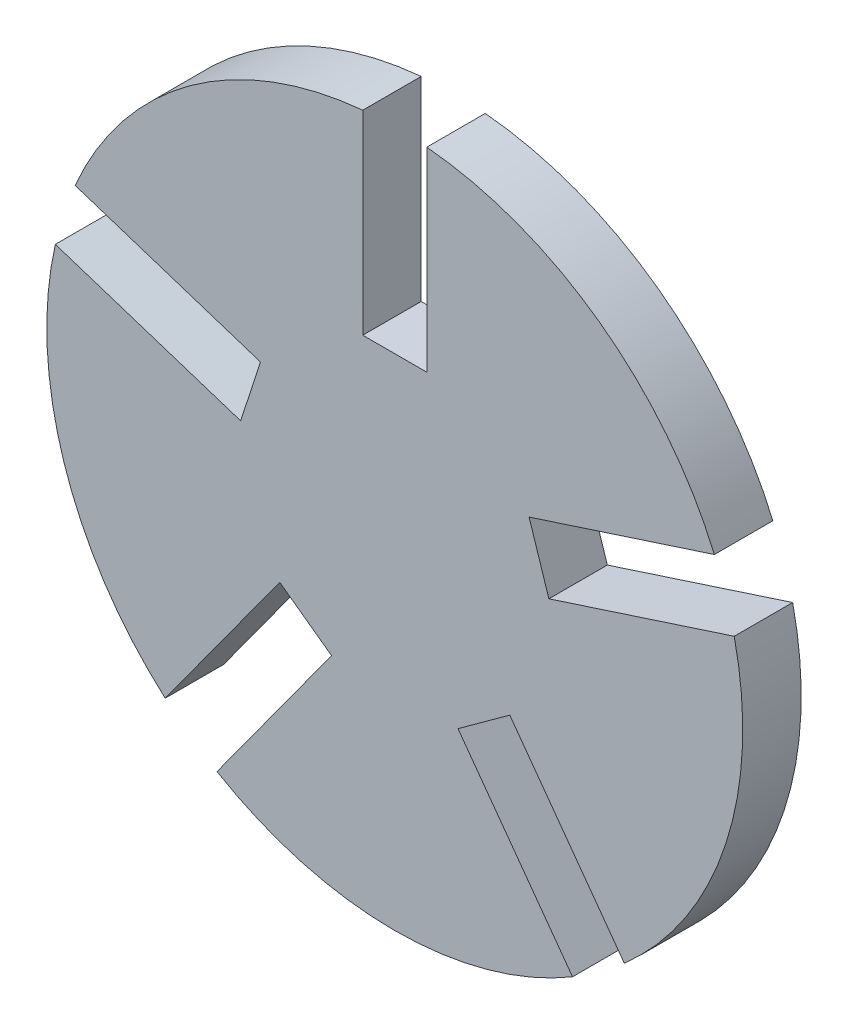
ISO-10303-21;
HEADER;
FILE_DESCRIPTION(('STEP AP214'),'2;1');
FILE_NAME('part.step','',(''),(''),'','','');
FILE_SCHEMA(('AUTOMOTIVE_DESIGN { 1 0 10303 214 1 1 1 1 }'));
ENDSEC;
DATA;
#1=APPLICATION_CONTEXT('core data for automotive mechanical design processes');
#2=APPLICATION_PROTOCOL_DEFINITION('international standard','automotive_design',2000,#1);
#3=PRODUCT_CONTEXT('',#1,'mechanical');
#4=PRODUCT('Part','Part','',(#3));
#5=PRODUCT_RELATED_PRODUCT_CATEGORY('part','',(#4));
#6=PRODUCT_DEFINITION_FORMATION('','',#4);
#7=PRODUCT_DEFINITION_CONTEXT('part definition',#1,'design');
#8=PRODUCT_DEFINITION('design','',#6,#7);
#9=PRODUCT_DEFINITION_SHAPE('','',#8);
#10=(LENGTH_UNIT() NAMED_UNIT(*) SI_UNIT(.MILLI.,.METRE.));
#11=(NAMED_UNIT(*) PLANE_ANGLE_UNIT() SI_UNIT($,.RADIAN.));
#12=(NAMED_UNIT(*) SI_UNIT($,.STERADIAN.) SOLID_ANGLE_UNIT());
#13=UNCERTAINTY_MEASURE_WITH_UNIT(LENGTH_MEASURE(1.E-05),#10,'distance_accuracy_value','');
#14=(GEOMETRIC_REPRESENTATION_CONTEXT(3) GLOBAL_UNCERTAINTY_ASSIGNED_CONTEXT((#13)) GLOBAL_UNIT_ASSIGNED_CONTEXT((#10,
#11,#12)) REPRESENTATION_CONTEXT('',''));
#15=CARTESIAN_POINT('',(0.,0.,0.));
#16=DIRECTION('',(0.,0.,1.));
#17=DIRECTION('',(1.,0.,0.));
#18=AXIS2_PLACEMENT_3D('',#15,#16,#17);
#19=CARTESIAN_POINT('',(0.,0.,2.1));
#20=DIRECTION('',(0.,0.,-1.));
#21=DIRECTION('',(-1.,0.,0.));
#22=AXIS2_PLACEMENT_3D('',#19,#20,#21);
#23=CYLINDRICAL_SURFACE('',#22,25.);
#24=CARTESIAN_POINT('',(0.,0.,-2.1));
#25=DIRECTION('',(0.,0.,1.));
#26=DIRECTION('',(1.,0.,0.));
#27=AXIS2_PLACEMENT_3D('',#24,#25,#26);
#28=CIRCLE('',#27,25.);
#29=CARTESIAN_POINT('',(-2.3,24.8939751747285,-2.1));
#30=VERTEX_POINT('',#29);
#31=CARTESIAN_POINT('',(-22.9648382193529,9.88009137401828,-2.1));
#32=VERTEX_POINT('',#31);
#33=EDGE_CURVE('E212',#30,#32,#28,.T.);
#34=ORIENTED_EDGE('',*,*,#33,.T.);
#35=DIRECTION('',(0.,0.,-1.));
#36=VECTOR('',#35,1.);
#37=CARTESIAN_POINT('',(-22.9648382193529,9.88009137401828,2.1));
#38=LINE('',#37,#36);
#39=CARTESIAN_POINT('',(-22.9648382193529,9.88009137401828,2.1));
#40=VERTEX_POINT('',#39);
#41=EDGE_CURVE('E11',#40,#32,#38,.T.);
#42=ORIENTED_EDGE('',*,*,#41,.F.);
#43=CARTESIAN_POINT('',(0.,0.,2.1));
#44=DIRECTION('',(0.,0.,1.));
#45=DIRECTION('',(1.,0.,0.));
#46=AXIS2_PLACEMENT_3D('',#43,#44,#45);
#47=CIRCLE('',#46,25.);
#48=CARTESIAN_POINT('',(-2.3,24.8939751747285,2.1));
#49=VERTEX_POINT('',#48);
#50=EDGE_CURVE('E270',#49,#40,#47,.T.);
#51=ORIENTED_EDGE('',*,*,#50,.F.);
#52=DIRECTION('',(0.,0.,-1.));
#53=VECTOR('',#52,1.);
#54=CARTESIAN_POINT('',(-2.3,24.8939751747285,2.1));
#55=LINE('',#54,#53);
#56=EDGE_CURVE('E208',#49,#30,#55,.T.);
#57=ORIENTED_EDGE('',*,*,#56,.T.);
#58=EDGE_LOOP('',(#34,#42,#51,#57));
#59=FACE_BOUND('',#58,.T.);
#60=ADVANCED_FACE('F39',(#59),#23,.T.);
#61=CARTESIAN_POINT('',(-22.9648382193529,9.88009137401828,2.1));
#62=DIRECTION('',(0.309016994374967,0.951056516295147,0.));
#63=DIRECTION('',(-0.951056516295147,0.309016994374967,0.));
#64=AXIS2_PLACEMENT_3D('',#61,#62,#63);
#65=PLANE('',#64);
#66=DIRECTION('',(0.951056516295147,-0.309016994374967,0.));
#67=VECTOR('',#66,1.);
#68=CARTESIAN_POINT('',(-22.9648382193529,9.88009137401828,-2.1));
#69=LINE('',#68,#67);
#70=CARTESIAN_POINT('',(-9.65004699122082,5.55385345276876,-2.1));
#71=VERTEX_POINT('',#70);
#72=EDGE_CURVE('E216',#32,#71,#69,.T.);
#73=ORIENTED_EDGE('',*,*,#72,.T.);
#74=DIRECTION('',(0.,0.,-1.));
#75=VECTOR('',#74,1.);
#76=CARTESIAN_POINT('',(-9.65004699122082,5.55385345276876,2.1));
#77=LINE('',#76,#75);
#78=CARTESIAN_POINT('',(-9.65004699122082,5.55385345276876,2.1));
#79=VERTEX_POINT('',#78);
#80=EDGE_CURVE('E48',#79,#71,#77,.T.);
#81=ORIENTED_EDGE('',*,*,#80,.F.);
#82=DIRECTION('',(0.951056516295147,-0.309016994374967,0.));
#83=VECTOR('',#82,1.);
#84=CARTESIAN_POINT('',(-22.9648382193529,9.88009137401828,2.1));
#85=LINE('',#84,#83);
#86=EDGE_CURVE('E135',#40,#79,#85,.T.);
#87=ORIENTED_EDGE('',*,*,#86,.F.);
#88=ORIENTED_EDGE('',*,*,#41,.T.);
#89=EDGE_LOOP('',(#73,#81,#87,#88));
#90=FACE_BOUND('',#89,.T.);
#91=ADVANCED_FACE('F420',(#90),#65,.F.);
#92=CARTESIAN_POINT('',(-11.0715251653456,1.17899347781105,2.1));
#93=DIRECTION('',(0.951056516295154,-0.309016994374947,0.));
#94=DIRECTION('',(0.309016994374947,0.951056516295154,0.));
#95=AXIS2_PLACEMENT_3D('',#92,#93,#94);
#96=PLANE('',#95);
#97=DIRECTION('',(-0.309016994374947,-0.951056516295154,0.));
#98=VECTOR('',#97,1.);
#99=CARTESIAN_POINT('',(-11.0715251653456,1.17899347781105,-2.1));
#100=LINE('',#99,#98);
#101=CARTESIAN_POINT('',(-11.0715251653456,1.17899347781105,-2.1));
#102=VERTEX_POINT('',#101);
#103=EDGE_CURVE('E219',#71,#102,#100,.T.);
#104=ORIENTED_EDGE('',*,*,#103,.T.);
#105=DIRECTION('',(0.,0.,-1.));
#106=VECTOR('',#105,1.);
#107=CARTESIAN_POINT('',(-11.0715251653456,1.17899347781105,2.1));
#108=LINE('',#107,#106);
#109=CARTESIAN_POINT('',(-11.0715251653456,1.17899347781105,2.1));
#110=VERTEX_POINT('',#109);
#111=EDGE_CURVE('E329',#110,#102,#108,.T.);
#112=ORIENTED_EDGE('',*,*,#111,.F.);
#113=DIRECTION('',(-0.309016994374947,-0.951056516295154,0.));
#114=VECTOR('',#113,1.);
#115=CARTESIAN_POINT('',(-11.0715251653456,1.17899347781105,2.1));
#116=LINE('',#115,#114);
#117=EDGE_CURVE('E339',#79,#110,#116,.T.);
#118=ORIENTED_EDGE('',*,*,#117,.F.);
#119=ORIENTED_EDGE('',*,*,#80,.T.);
#120=EDGE_LOOP('',(#104,#112,#118,#119));
#121=FACE_BOUND('',#120,.T.);
#122=ADVANCED_FACE('F337',(#121),#96,.F.);
#123=CARTESIAN_POINT('',(-24.3863163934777,5.50523139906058,2.1));
#124=DIRECTION('',(-0.309016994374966,-0.951056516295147,0.));
#125=DIRECTION('',(0.951056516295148,-0.309016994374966,0.));
#126=AXIS2_PLACEMENT_3D('',#123,#124,#125);
#127=PLANE('',#126);
#128=DIRECTION('',(-0.951056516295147,0.309016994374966,0.));
#129=VECTOR('',#128,1.);
#130=CARTESIAN_POINT('',(-24.3863163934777,5.50523139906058,-2.1));
#131=LINE('',#130,#129);
#132=CARTESIAN_POINT('',(-24.3863163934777,5.50523139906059,-2.1));
#133=VERTEX_POINT('',#132);
#134=EDGE_CURVE('E222',#102,#133,#131,.T.);
#135=ORIENTED_EDGE('',*,*,#134,.T.);
#136=DIRECTION('',(0.,0.,-1.));
#137=VECTOR('',#136,1.);
#138=CARTESIAN_POINT('',(-24.3863163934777,5.50523139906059,2.1));
#139=LINE('',#138,#137);
#140=CARTESIAN_POINT('',(-24.3863163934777,5.50523139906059,2.1));
#141=VERTEX_POINT('',#140);
#142=EDGE_CURVE('E325',#141,#133,#139,.T.);
#143=ORIENTED_EDGE('',*,*,#142,.F.);
#144=DIRECTION('',(-0.951056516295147,0.309016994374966,0.));
#145=VECTOR('',#144,1.);
#146=CARTESIAN_POINT('',(-24.3863163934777,5.50523139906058,2.1));
#147=LINE('',#146,#145);
#148=EDGE_CURVE('E358',#110,#141,#147,.T.);
#149=ORIENTED_EDGE('',*,*,#148,.F.);
#150=ORIENTED_EDGE('',*,*,#111,.T.);
#151=EDGE_LOOP('',(#135,#143,#149,#150));
#152=FACE_BOUND('',#151,.T.);
#153=ADVANCED_FACE('F348',(#152),#127,.F.);
#154=CARTESIAN_POINT('',(0.,0.,2.1));
#155=DIRECTION('',(0.,0.,-1.));
#156=DIRECTION('',(-1.,0.,0.));
#157=AXIS2_PLACEMENT_3D('',#154,#155,#156);
#158=CYLINDRICAL_SURFACE('',#157,25.);
#159=CARTESIAN_POINT('',(0.,0.,-2.1));
#160=DIRECTION('',(0.,0.,1.));
#161=DIRECTION('',(1.,0.,0.));
#162=AXIS2_PLACEMENT_3D('',#159,#160,#161);
#163=CIRCLE('',#162,25.);
#164=CARTESIAN_POINT('',(-16.4930505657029,-18.7877428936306,-2.1));
#165=VERTEX_POINT('',#164);
#166=EDGE_CURVE('E225',#133,#165,#163,.T.);
#167=ORIENTED_EDGE('',*,*,#166,.T.);
#168=DIRECTION('',(0.,0.,-1.));
#169=VECTOR('',#168,1.);
#170=CARTESIAN_POINT('',(-16.4930505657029,-18.7877428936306,2.1));
#171=LINE('',#170,#169);
#172=CARTESIAN_POINT('',(-16.4930505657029,-18.7877428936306,2.1));
#173=VERTEX_POINT('',#172);
#174=EDGE_CURVE('E321',#173,#165,#171,.T.);
#175=ORIENTED_EDGE('',*,*,#174,.F.);
#176=CARTESIAN_POINT('',(0.,0.,2.1));
#177=DIRECTION('',(0.,0.,1.));
#178=DIRECTION('',(1.,0.,0.));
#179=AXIS2_PLACEMENT_3D('',#176,#177,#178);
#180=CIRCLE('',#179,25.);
#181=EDGE_CURVE('E354',#141,#173,#180,.T.);
#182=ORIENTED_EDGE('',*,*,#181,.F.);
#183=ORIENTED_EDGE('',*,*,#142,.T.);
#184=EDGE_LOOP('',(#167,#175,#182,#183));
#185=FACE_BOUND('',#184,.T.);
#186=ADVANCED_FACE('F352',(#185),#158,.T.);
#187=CARTESIAN_POINT('',(-16.4930505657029,-18.7877428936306,2.1));
#188=DIRECTION('',(-0.809016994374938,0.587785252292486,0.));
#189=DIRECTION('',(-0.587785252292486,-0.809016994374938,0.));
#190=AXIS2_PLACEMENT_3D('',#187,#188,#189);
#191=PLANE('',#190);
#192=DIRECTION('',(0.587785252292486,0.809016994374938,0.));
#193=VECTOR('',#192,1.);
#194=CARTESIAN_POINT('',(-16.4930505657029,-18.7877428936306,-2.1));
#195=LINE('',#194,#193);
#196=CARTESIAN_POINT('',(-8.26405703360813,-7.46150497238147,-2.1));
#197=VERTEX_POINT('',#196);
#198=EDGE_CURVE('E228',#165,#197,#195,.T.);
#199=ORIENTED_EDGE('',*,*,#198,.T.);
#200=DIRECTION('',(0.,0.,-1.));
#201=VECTOR('',#200,1.);
#202=CARTESIAN_POINT('',(-8.26405703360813,-7.46150497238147,2.1));
#203=LINE('',#202,#201);
#204=CARTESIAN_POINT('',(-8.26405703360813,-7.46150497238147,2.1));
#205=VERTEX_POINT('',#204);
#206=EDGE_CURVE('E317',#205,#197,#203,.T.);
#207=ORIENTED_EDGE('',*,*,#206,.F.);
#208=DIRECTION('',(0.587785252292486,0.809016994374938,0.));
#209=VECTOR('',#208,1.);
#210=CARTESIAN_POINT('',(-16.4930505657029,-18.7877428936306,2.1));
#211=LINE('',#210,#209);
#212=EDGE_CURVE('E357',#173,#205,#211,.T.);
#213=ORIENTED_EDGE('',*,*,#212,.F.);
#214=ORIENTED_EDGE('',*,*,#174,.T.);
#215=EDGE_LOOP('',(#199,#207,#213,#214));
#216=FACE_BOUND('',#215,.T.);
#217=ADVANCED_FACE('F433',(#216),#191,.F.);
#218=CARTESIAN_POINT('',(-4.54257885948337,-10.1653171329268,2.1));
#219=DIRECTION('',(0.587785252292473,0.809016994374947,0.));
#220=DIRECTION('',(-0.809016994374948,0.587785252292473,0.));
#221=AXIS2_PLACEMENT_3D('',#218,#219,#220);
#222=PLANE('',#221);
#223=DIRECTION('',(0.809016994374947,-0.587785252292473,0.));
#224=VECTOR('',#223,1.);
#225=CARTESIAN_POINT('',(-4.54257885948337,-10.1653171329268,-2.1));
#226=LINE('',#225,#224);
#227=CARTESIAN_POINT('',(-4.54257885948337,-10.1653171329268,-2.1));
#228=VERTEX_POINT('',#227);
#229=EDGE_CURVE('E231',#197,#228,#226,.T.);
#230=ORIENTED_EDGE('',*,*,#229,.T.);
#231=DIRECTION('',(0.,0.,-1.));
#232=VECTOR('',#231,1.);
#233=CARTESIAN_POINT('',(-4.54257885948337,-10.1653171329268,2.1));
#234=LINE('',#233,#232);
#235=CARTESIAN_POINT('',(-4.54257885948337,-10.1653171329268,2.1));
#236=VERTEX_POINT('',#235);
#237=EDGE_CURVE('E313',#236,#228,#234,.T.);
#238=ORIENTED_EDGE('',*,*,#237,.F.);
#239=DIRECTION('',(0.809016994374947,-0.587785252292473,0.));
#240=VECTOR('',#239,1.);
#241=CARTESIAN_POINT('',(-4.54257885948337,-10.1653171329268,2.1));
#242=LINE('',#241,#240);
#243=EDGE_CURVE('E362',#205,#236,#242,.T.);
#244=ORIENTED_EDGE('',*,*,#243,.F.);
#245=ORIENTED_EDGE('',*,*,#206,.T.);
#246=EDGE_LOOP('',(#230,#238,#244,#245));
#247=FACE_BOUND('',#246,.T.);
#248=ADVANCED_FACE('F436',(#247),#222,.F.);
#249=CARTESIAN_POINT('',(-12.7715723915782,-21.491555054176,2.1));
#250=DIRECTION('',(0.809016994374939,-0.587785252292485,0.));
#251=DIRECTION('',(0.587785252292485,0.809016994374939,0.));
#252=AXIS2_PLACEMENT_3D('',#249,#250,#251);
#253=PLANE('',#252);
#254=DIRECTION('',(-0.587785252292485,-0.809016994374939,0.));
#255=VECTOR('',#254,1.);
#256=CARTESIAN_POINT('',(-12.7715723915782,-21.491555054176,-2.1));
#257=LINE('',#256,#255);
#258=CARTESIAN_POINT('',(-12.7715723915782,-21.491555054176,-2.1));
#259=VERTEX_POINT('',#258);
#260=EDGE_CURVE('E234',#228,#259,#257,.T.);
#261=ORIENTED_EDGE('',*,*,#260,.T.);
#262=DIRECTION('',(0.,0.,-1.));
#263=VECTOR('',#262,1.);
#264=CARTESIAN_POINT('',(-12.7715723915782,-21.491555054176,2.1));
#265=LINE('',#264,#263);
#266=CARTESIAN_POINT('',(-12.7715723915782,-21.491555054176,2.1));
#267=VERTEX_POINT('',#266);
#268=EDGE_CURVE('E309',#267,#259,#265,.T.);
#269=ORIENTED_EDGE('',*,*,#268,.F.);
#270=DIRECTION('',(-0.587785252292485,-0.809016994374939,0.));
#271=VECTOR('',#270,1.);
#272=CARTESIAN_POINT('',(-12.7715723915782,-21.491555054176,2.1));
#273=LINE('',#272,#271);
#274=EDGE_CURVE('E369',#236,#267,#273,.T.);
#275=ORIENTED_EDGE('',*,*,#274,.F.);
#276=ORIENTED_EDGE('',*,*,#237,.T.);
#277=EDGE_LOOP('',(#261,#269,#275,#276));
#278=FACE_BOUND('',#277,.T.);
#279=ADVANCED_FACE('F440',(#278),#253,.F.);
#280=CARTESIAN_POINT('',(0.,0.,2.1));
#281=DIRECTION('',(0.,0.,-1.));
#282=DIRECTION('',(-1.,0.,0.));
#283=AXIS2_PLACEMENT_3D('',#280,#281,#282);
#284=CYLINDRICAL_SURFACE('',#283,25.);
#285=CARTESIAN_POINT('',(0.,0.,-2.1));
#286=DIRECTION('',(0.,0.,1.));
#287=DIRECTION('',(1.,0.,0.));
#288=AXIS2_PLACEMENT_3D('',#285,#286,#287);
#289=CIRCLE('',#288,25.);
#290=CARTESIAN_POINT('',(12.7715723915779,-21.4915550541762,-2.1));
#291=VERTEX_POINT('',#290);
#292=EDGE_CURVE('E237',#259,#291,#289,.T.);
#293=ORIENTED_EDGE('',*,*,#292,.T.);
#294=DIRECTION('',(0.,0.,-1.));
#295=VECTOR('',#294,1.);
#296=CARTESIAN_POINT('',(12.7715723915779,-21.4915550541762,2.1));
#297=LINE('',#296,#295);
#298=CARTESIAN_POINT('',(12.7715723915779,-21.4915550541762,2.1));
#299=VERTEX_POINT('',#298);
#300=EDGE_CURVE('E305',#299,#291,#297,.T.);
#301=ORIENTED_EDGE('',*,*,#300,.F.);
#302=CARTESIAN_POINT('',(0.,0.,2.1));
#303=DIRECTION('',(0.,0.,1.));
#304=DIRECTION('',(1.,0.,0.));
#305=AXIS2_PLACEMENT_3D('',#302,#303,#304);
#306=CIRCLE('',#305,25.);
#307=EDGE_CURVE('E372',#267,#299,#306,.T.);
#308=ORIENTED_EDGE('',*,*,#307,.F.);
#309=ORIENTED_EDGE('',*,*,#268,.T.);
#310=EDGE_LOOP('',(#293,#301,#308,#309));
#311=FACE_BOUND('',#310,.T.);
#312=ADVANCED_FACE('F444',(#311),#284,.T.);
#313=CARTESIAN_POINT('',(12.7715723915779,-21.4915550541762,2.1));
#314=DIRECTION('',(-0.809016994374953,-0.587785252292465,0.));
#315=DIRECTION('',(0.587785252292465,-0.809016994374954,0.));
#316=AXIS2_PLACEMENT_3D('',#313,#314,#315);
#317=PLANE('',#316);
#318=DIRECTION('',(-0.587785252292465,0.809016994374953,0.));
#319=VECTOR('',#318,1.);
#320=CARTESIAN_POINT('',(12.7715723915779,-21.4915550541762,-2.1));
#321=LINE('',#320,#319);
#322=CARTESIAN_POINT('',(4.54257885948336,-10.1653171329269,-2.1));
#323=VERTEX_POINT('',#322);
#324=EDGE_CURVE('E240',#291,#323,#321,.T.);
#325=ORIENTED_EDGE('',*,*,#324,.T.);
#326=DIRECTION('',(0.,0.,-1.));
#327=VECTOR('',#326,1.);
#328=CARTESIAN_POINT('',(4.54257885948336,-10.1653171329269,2.1));
#329=LINE('',#328,#327);
#330=CARTESIAN_POINT('',(4.54257885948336,-10.1653171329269,2.1));
#331=VERTEX_POINT('',#330);
#332=EDGE_CURVE('E301',#331,#323,#329,.T.);
#333=ORIENTED_EDGE('',*,*,#332,.F.);
#334=DIRECTION('',(-0.587785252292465,0.809016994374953,0.));
#335=VECTOR('',#334,1.);
#336=CARTESIAN_POINT('',(12.7715723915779,-21.4915550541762,2.1));
#337=LINE('',#336,#335);
#338=EDGE_CURVE('E375',#299,#331,#337,.T.);
#339=ORIENTED_EDGE('',*,*,#338,.F.);
#340=ORIENTED_EDGE('',*,*,#300,.T.);
#341=EDGE_LOOP('',(#325,#333,#339,#340));
#342=FACE_BOUND('',#341,.T.);
#343=ADVANCED_FACE('F448',(#342),#317,.F.);
#344=CARTESIAN_POINT('',(8.26405703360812,-7.46150497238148,2.1));
#345=DIRECTION('',(-0.587785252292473,0.809016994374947,0.));
#346=DIRECTION('',(-0.809016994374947,-0.587785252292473,0.));
#347=AXIS2_PLACEMENT_3D('',#344,#345,#346);
#348=PLANE('',#347);
#349=DIRECTION('',(0.809016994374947,0.587785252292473,0.));
#350=VECTOR('',#349,1.);
#351=CARTESIAN_POINT('',(8.26405703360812,-7.46150497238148,-2.1));
#352=LINE('',#351,#350);
#353=CARTESIAN_POINT('',(8.26405703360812,-7.46150497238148,-2.1));
#354=VERTEX_POINT('',#353);
#355=EDGE_CURVE('E243',#323,#354,#352,.T.);
#356=ORIENTED_EDGE('',*,*,#355,.T.);
#357=DIRECTION('',(0.,0.,-1.));
#358=VECTOR('',#357,1.);
#359=CARTESIAN_POINT('',(8.26405703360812,-7.46150497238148,2.1));
#360=LINE('',#359,#358);
#361=CARTESIAN_POINT('',(8.26405703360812,-7.46150497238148,2.1));
#362=VERTEX_POINT('',#361);
#363=EDGE_CURVE('E297',#362,#354,#360,.T.);
#364=ORIENTED_EDGE('',*,*,#363,.F.);
#365=DIRECTION('',(0.809016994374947,0.587785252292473,0.));
#366=VECTOR('',#365,1.);
#367=CARTESIAN_POINT('',(8.26405703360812,-7.46150497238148,2.1));
#368=LINE('',#367,#366);
#369=EDGE_CURVE('E378',#331,#362,#368,.T.);
#370=ORIENTED_EDGE('',*,*,#369,.F.);
#371=ORIENTED_EDGE('',*,*,#332,.T.);
#372=EDGE_LOOP('',(#356,#364,#370,#371));
#373=FACE_BOUND('',#372,.T.);
#374=ADVANCED_FACE('F452',(#373),#348,.F.);
#375=CARTESIAN_POINT('',(16.4930505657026,-18.7877428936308,2.1));
#376=DIRECTION('',(0.809016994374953,0.587785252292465,0.));
#377=DIRECTION('',(-0.587785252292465,0.809016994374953,0.));
#378=AXIS2_PLACEMENT_3D('',#375,#376,#377);
#379=PLANE('',#378);
#380=DIRECTION('',(0.587785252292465,-0.809016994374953,0.));
#381=VECTOR('',#380,1.);
#382=CARTESIAN_POINT('',(16.4930505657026,-18.7877428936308,-2.1));
#383=LINE('',#382,#381);
#384=CARTESIAN_POINT('',(16.4930505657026,-18.7877428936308,-2.1));
#385=VERTEX_POINT('',#384);
#386=EDGE_CURVE('E246',#354,#385,#383,.T.);
#387=ORIENTED_EDGE('',*,*,#386,.T.);
#388=DIRECTION('',(0.,0.,-1.));
#389=VECTOR('',#388,1.);
#390=CARTESIAN_POINT('',(16.4930505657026,-18.7877428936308,2.1));
#391=LINE('',#390,#389);
#392=CARTESIAN_POINT('',(16.4930505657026,-18.7877428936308,2.1));
#393=VERTEX_POINT('',#392);
#394=EDGE_CURVE('E293',#393,#385,#391,.T.);
#395=ORIENTED_EDGE('',*,*,#394,.F.);
#396=DIRECTION('',(0.587785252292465,-0.809016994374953,0.));
#397=VECTOR('',#396,1.);
#398=CARTESIAN_POINT('',(16.4930505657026,-18.7877428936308,2.1));
#399=LINE('',#398,#397);
#400=EDGE_CURVE('E381',#362,#393,#399,.T.);
#401=ORIENTED_EDGE('',*,*,#400,.F.);
#402=ORIENTED_EDGE('',*,*,#363,.T.);
#403=EDGE_LOOP('',(#387,#395,#401,#402));
#404=FACE_BOUND('',#403,.T.);
#405=ADVANCED_FACE('F456',(#404),#379,.F.);
#406=CARTESIAN_POINT('',(0.,0.,2.1));
#407=DIRECTION('',(0.,0.,-1.));
#408=DIRECTION('',(-1.,0.,0.));
#409=AXIS2_PLACEMENT_3D('',#406,#407,#408);
#410=CYLINDRICAL_SURFACE('',#409,25.);
#411=CARTESIAN_POINT('',(0.,0.,-2.1));
#412=DIRECTION('',(0.,0.,1.));
#413=DIRECTION('',(1.,0.,0.));
#414=AXIS2_PLACEMENT_3D('',#411,#412,#413);
#415=CIRCLE('',#414,25.);
#416=CARTESIAN_POINT('',(24.3863163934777,5.50523139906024,-2.1));
#417=VERTEX_POINT('',#416);
#418=EDGE_CURVE('E249',#385,#417,#415,.T.);
#419=ORIENTED_EDGE('',*,*,#418,.T.);
#420=DIRECTION('',(0.,0.,-1.));
#421=VECTOR('',#420,1.);
#422=CARTESIAN_POINT('',(24.3863163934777,5.50523139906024,2.1));
#423=LINE('',#422,#421);
#424=CARTESIAN_POINT('',(24.3863163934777,5.50523139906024,2.1));
#425=VERTEX_POINT('',#424);
#426=EDGE_CURVE('E289',#425,#417,#423,.T.);
#427=ORIENTED_EDGE('',*,*,#426,.F.);
#428=CARTESIAN_POINT('',(0.,0.,2.1));
#429=DIRECTION('',(0.,0.,1.));
#430=DIRECTION('',(1.,0.,0.));
#431=AXIS2_PLACEMENT_3D('',#428,#429,#430);
#432=CIRCLE('',#431,25.);
#433=EDGE_CURVE('E384',#393,#425,#432,.T.);
#434=ORIENTED_EDGE('',*,*,#433,.F.);
#435=ORIENTED_EDGE('',*,*,#394,.T.);
#436=EDGE_LOOP('',(#419,#427,#434,#435));
#437=FACE_BOUND('',#436,.T.);
#438=ADVANCED_FACE('F460',(#437),#410,.T.);
#439=CARTESIAN_POINT('',(24.3863163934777,5.50523139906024,2.1));
#440=DIRECTION('',(0.309016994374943,-0.951056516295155,0.));
#441=DIRECTION('',(0.951056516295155,0.309016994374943,0.));
#442=AXIS2_PLACEMENT_3D('',#439,#440,#441);
#443=PLANE('',#442);
#444=DIRECTION('',(-0.951056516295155,-0.309016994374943,0.));
#445=VECTOR('',#444,1.);
#446=CARTESIAN_POINT('',(24.3863163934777,5.50523139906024,-2.1));
#447=LINE('',#446,#445);
#448=CARTESIAN_POINT('',(11.0715251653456,1.17899347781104,-2.1));
#449=VERTEX_POINT('',#448);
#450=EDGE_CURVE('E252',#417,#449,#447,.T.);
#451=ORIENTED_EDGE('',*,*,#450,.T.);
#452=DIRECTION('',(0.,0.,-1.));
#453=VECTOR('',#452,1.);
#454=CARTESIAN_POINT('',(11.0715251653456,1.17899347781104,2.1));
#455=LINE('',#454,#453);
#456=CARTESIAN_POINT('',(11.0715251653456,1.17899347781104,2.1));
#457=VERTEX_POINT('',#456);
#458=EDGE_CURVE('E285',#457,#449,#455,.T.);
#459=ORIENTED_EDGE('',*,*,#458,.F.);
#460=DIRECTION('',(-0.951056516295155,-0.309016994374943,0.));
#461=VECTOR('',#460,1.);
#462=CARTESIAN_POINT('',(24.3863163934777,5.50523139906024,2.1));
#463=LINE('',#462,#461);
#464=EDGE_CURVE('E387',#425,#457,#463,.T.);
#465=ORIENTED_EDGE('',*,*,#464,.F.);
#466=ORIENTED_EDGE('',*,*,#426,.T.);
#467=EDGE_LOOP('',(#451,#459,#465,#466));
#468=FACE_BOUND('',#467,.T.);
#469=ADVANCED_FACE('F464',(#468),#443,.F.);
#470=CARTESIAN_POINT('',(9.65004699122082,5.55385345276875,2.1));
#471=DIRECTION('',(-0.951056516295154,-0.309016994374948,0.));
#472=DIRECTION('',(0.309016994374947,-0.951056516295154,0.));
#473=AXIS2_PLACEMENT_3D('',#470,#471,#472);
#474=PLANE('',#473);
#475=DIRECTION('',(-0.309016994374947,0.951056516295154,0.));
#476=VECTOR('',#475,1.);
#477=CARTESIAN_POINT('',(9.65004699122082,5.55385345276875,-2.1));
#478=LINE('',#477,#476);
#479=CARTESIAN_POINT('',(9.65004699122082,5.55385345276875,-2.1));
#480=VERTEX_POINT('',#479);
#481=EDGE_CURVE('E255',#449,#480,#478,.T.);
#482=ORIENTED_EDGE('',*,*,#481,.T.);
#483=DIRECTION('',(0.,0.,-1.));
#484=VECTOR('',#483,1.);
#485=CARTESIAN_POINT('',(9.65004699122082,5.55385345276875,2.1));
#486=LINE('',#485,#484);
#487=CARTESIAN_POINT('',(9.65004699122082,5.55385345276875,2.1));
#488=VERTEX_POINT('',#487);
#489=EDGE_CURVE('E281',#488,#480,#486,.T.);
#490=ORIENTED_EDGE('',*,*,#489,.F.);
#491=DIRECTION('',(-0.309016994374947,0.951056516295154,0.));
#492=VECTOR('',#491,1.);
#493=CARTESIAN_POINT('',(9.65004699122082,5.55385345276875,2.1));
#494=LINE('',#493,#492);
#495=EDGE_CURVE('E390',#457,#488,#494,.T.);
#496=ORIENTED_EDGE('',*,*,#495,.F.);
#497=ORIENTED_EDGE('',*,*,#458,.T.);
#498=EDGE_LOOP('',(#482,#490,#496,#497));
#499=FACE_BOUND('',#498,.T.);
#500=ADVANCED_FACE('F468',(#499),#474,.F.);
#501=CARTESIAN_POINT('',(22.964838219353,9.88009137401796,2.1));
#502=DIRECTION('',(-0.309016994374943,0.951056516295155,0.));
#503=DIRECTION('',(-0.951056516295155,-0.309016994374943,0.));
#504=AXIS2_PLACEMENT_3D('',#501,#502,#503);
#505=PLANE('',#504);
#506=DIRECTION('',(0.951056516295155,0.309016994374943,0.));
#507=VECTOR('',#506,1.);
#508=CARTESIAN_POINT('',(22.964838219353,9.88009137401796,-2.1));
#509=LINE('',#508,#507);
#510=CARTESIAN_POINT('',(22.964838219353,9.88009137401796,-2.1));
#511=VERTEX_POINT('',#510);
#512=EDGE_CURVE('E258',#480,#511,#509,.T.);
#513=ORIENTED_EDGE('',*,*,#512,.T.);
#514=DIRECTION('',(0.,0.,-1.));
#515=VECTOR('',#514,1.);
#516=CARTESIAN_POINT('',(22.964838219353,9.88009137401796,2.1));
#517=LINE('',#516,#515);
#518=CARTESIAN_POINT('',(22.964838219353,9.88009137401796,2.1));
#519=VERTEX_POINT('',#518);
#520=EDGE_CURVE('E277',#519,#511,#517,.T.);
#521=ORIENTED_EDGE('',*,*,#520,.F.);
#522=DIRECTION('',(0.951056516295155,0.309016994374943,0.));
#523=VECTOR('',#522,1.);
#524=CARTESIAN_POINT('',(22.964838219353,9.88009137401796,2.1));
#525=LINE('',#524,#523);
#526=EDGE_CURVE('E393',#488,#519,#525,.T.);
#527=ORIENTED_EDGE('',*,*,#526,.F.);
#528=ORIENTED_EDGE('',*,*,#489,.T.);
#529=EDGE_LOOP('',(#513,#521,#527,#528));
#530=FACE_BOUND('',#529,.T.);
#531=ADVANCED_FACE('F401',(#530),#505,.F.);
#532=CARTESIAN_POINT('',(0.,0.,2.1));
#533=DIRECTION('',(0.,0.,-1.));
#534=DIRECTION('',(-1.,0.,0.));
#535=AXIS2_PLACEMENT_3D('',#532,#533,#534);
#536=CYLINDRICAL_SURFACE('',#535,25.);
#537=CARTESIAN_POINT('',(0.,0.,-2.1));
#538=DIRECTION('',(0.,0.,1.));
#539=DIRECTION('',(1.,0.,0.));
#540=AXIS2_PLACEMENT_3D('',#537,#538,#539);
#541=CIRCLE('',#540,25.);
#542=CARTESIAN_POINT('',(2.3,24.8939751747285,-2.1));
#543=VERTEX_POINT('',#542);
#544=EDGE_CURVE('E261',#511,#543,#541,.T.);
#545=ORIENTED_EDGE('',*,*,#544,.T.);
#546=DIRECTION('',(0.,0.,-1.));
#547=VECTOR('',#546,1.);
#548=CARTESIAN_POINT('',(2.3,24.8939751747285,2.1));
#549=LINE('',#548,#547);
#550=CARTESIAN_POINT('',(2.3,24.8939751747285,2.1));
#551=VERTEX_POINT('',#550);
#552=EDGE_CURVE('E201',#551,#543,#549,.T.);
#553=ORIENTED_EDGE('',*,*,#552,.F.);
#554=CARTESIAN_POINT('',(0.,0.,2.1));
#555=DIRECTION('',(0.,0.,1.));
#556=DIRECTION('',(1.,0.,0.));
#557=AXIS2_PLACEMENT_3D('',#554,#555,#556);
#558=CIRCLE('',#557,25.);
#559=EDGE_CURVE('E190',#519,#551,#558,.T.);
#560=ORIENTED_EDGE('',*,*,#559,.F.);
#561=ORIENTED_EDGE('',*,*,#520,.T.);
#562=EDGE_LOOP('',(#545,#553,#560,#561));
#563=FACE_BOUND('',#562,.T.);
#564=ADVANCED_FACE('F405',(#563),#536,.T.);
#565=CARTESIAN_POINT('',(2.3,24.8939751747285,2.1));
#566=DIRECTION('',(1.,0.,0.));
#567=DIRECTION('',(0.,1.,0.));
#568=AXIS2_PLACEMENT_3D('',#565,#566,#567);
#569=PLANE('',#568);
#570=DIRECTION('',(0.,-1.,0.));
#571=VECTOR('',#570,1.);
#572=CARTESIAN_POINT('',(2.3,24.8939751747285,-2.1));
#573=LINE('',#572,#571);
#574=CARTESIAN_POINT('',(2.30000000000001,10.8939751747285,-2.1));
#575=VERTEX_POINT('',#574);
#576=EDGE_CURVE('E199',#543,#575,#573,.T.);
#577=ORIENTED_EDGE('',*,*,#576,.T.);
#578=DIRECTION('',(0.,0.,-1.));
#579=VECTOR('',#578,1.);
#580=CARTESIAN_POINT('',(2.30000000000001,10.8939751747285,2.1));
#581=LINE('',#580,#579);
#582=CARTESIAN_POINT('',(2.30000000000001,10.8939751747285,2.1));
#583=VERTEX_POINT('',#582);
#584=EDGE_CURVE('E196',#583,#575,#581,.T.);
#585=ORIENTED_EDGE('',*,*,#584,.F.);
#586=DIRECTION('',(0.,-1.,0.));
#587=VECTOR('',#586,1.);
#588=CARTESIAN_POINT('',(2.3,24.8939751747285,2.1));
#589=LINE('',#588,#587);
#590=EDGE_CURVE('E184',#551,#583,#589,.T.);
#591=ORIENTED_EDGE('',*,*,#590,.F.);
#592=ORIENTED_EDGE('',*,*,#552,.T.);
#593=EDGE_LOOP('',(#577,#585,#591,#592));
#594=FACE_BOUND('',#593,.T.);
#595=ADVANCED_FACE('F197',(#594),#569,.F.);
#596=CARTESIAN_POINT('',(-2.29999999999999,10.8939751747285,2.1));
#597=DIRECTION('',(0.,-1.,0.));
#598=DIRECTION('',(0.,0.,-1.));
#599=AXIS2_PLACEMENT_3D('',#596,#597,#598);
#600=PLANE('',#599);
#601=DIRECTION('',(-1.,0.,0.));
#602=VECTOR('',#601,1.);
#603=CARTESIAN_POINT('',(-2.29999999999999,10.8939751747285,-2.1));
#604=LINE('',#603,#602);
#605=CARTESIAN_POINT('',(-2.29999999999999,10.8939751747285,-2.1));
#606=VERTEX_POINT('',#605);
#607=EDGE_CURVE('E121',#575,#606,#604,.T.);
#608=ORIENTED_EDGE('',*,*,#607,.T.);
#609=DIRECTION('',(0.,0.,-1.));
#610=VECTOR('',#609,1.);
#611=CARTESIAN_POINT('',(-2.29999999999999,10.8939751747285,2.1));
#612=LINE('',#611,#610);
#613=CARTESIAN_POINT('',(-2.29999999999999,10.8939751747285,2.1));
#614=VERTEX_POINT('',#613);
#615=EDGE_CURVE('E202',#614,#606,#612,.T.);
#616=ORIENTED_EDGE('',*,*,#615,.F.);
#617=DIRECTION('',(-1.,0.,0.));
#618=VECTOR('',#617,1.);
#619=CARTESIAN_POINT('',(-2.29999999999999,10.8939751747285,2.1));
#620=LINE('',#619,#618);
#621=EDGE_CURVE('E188',#583,#614,#620,.T.);
#622=ORIENTED_EDGE('',*,*,#621,.F.);
#623=ORIENTED_EDGE('',*,*,#584,.T.);
#624=EDGE_LOOP('',(#608,#616,#622,#623));
#625=FACE_BOUND('',#624,.T.);
#626=ADVANCED_FACE('F204',(#625),#600,.F.);
#627=CARTESIAN_POINT('',(-2.3,24.8939751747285,2.1));
#628=DIRECTION('',(-1.,0.,0.));
#629=DIRECTION('',(0.,-1.,0.));
#630=AXIS2_PLACEMENT_3D('',#627,#628,#629);
#631=PLANE('',#630);
#632=DIRECTION('',(0.,1.,0.));
#633=VECTOR('',#632,1.);
#634=CARTESIAN_POINT('',(-2.3,24.8939751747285,-2.1));
#635=LINE('',#634,#633);
#636=EDGE_CURVE('E127',#606,#30,#635,.T.);
#637=ORIENTED_EDGE('',*,*,#636,.T.);
#638=ORIENTED_EDGE('',*,*,#56,.F.);
#639=DIRECTION('',(0.,1.,0.));
#640=VECTOR('',#639,1.);
#641=CARTESIAN_POINT('',(-2.3,24.8939751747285,2.1));
#642=LINE('',#641,#640);
#643=EDGE_CURVE('E56',#614,#49,#642,.T.);
#644=ORIENTED_EDGE('',*,*,#643,.F.);
#645=ORIENTED_EDGE('',*,*,#615,.T.);
#646=EDGE_LOOP('',(#637,#638,#644,#645));
#647=FACE_BOUND('',#646,.T.);
#648=ADVANCED_FACE('F409',(#647),#631,.F.);
#649=CARTESIAN_POINT('',(0.,0.,2.1));
#650=DIRECTION('',(0.,0.,1.));
#651=DIRECTION('',(1.,0.,0.));
#652=AXIS2_PLACEMENT_3D('',#649,#650,#651);
#653=PLANE('',#652);
#654=ORIENTED_EDGE('',*,*,#50,.T.);
#655=ORIENTED_EDGE('',*,*,#86,.T.);
#656=ORIENTED_EDGE('',*,*,#117,.T.);
#657=ORIENTED_EDGE('',*,*,#148,.T.);
#658=ORIENTED_EDGE('',*,*,#181,.T.);
#659=ORIENTED_EDGE('',*,*,#212,.T.);
#660=ORIENTED_EDGE('',*,*,#243,.T.);
#661=ORIENTED_EDGE('',*,*,#274,.T.);
#662=ORIENTED_EDGE('',*,*,#307,.T.);
#663=ORIENTED_EDGE('',*,*,#338,.T.);
#664=ORIENTED_EDGE('',*,*,#369,.T.);
#665=ORIENTED_EDGE('',*,*,#400,.T.);
#666=ORIENTED_EDGE('',*,*,#433,.T.);
#667=ORIENTED_EDGE('',*,*,#464,.T.);
#668=ORIENTED_EDGE('',*,*,#495,.T.);
#669=ORIENTED_EDGE('',*,*,#526,.T.);
#670=ORIENTED_EDGE('',*,*,#559,.T.);
#671=ORIENTED_EDGE('',*,*,#590,.T.);
#672=ORIENTED_EDGE('',*,*,#621,.T.);
#673=ORIENTED_EDGE('',*,*,#643,.T.);
#674=EDGE_LOOP('',(#654,#655,#656,#657,#658,#659,#660,#661,#662,#663,#664,#665,#666,#667,#668,
#669,#670,#671,#672,#673));
#675=FACE_BOUND('',#674,.T.);
#676=ADVANCED_FACE('F186',(#675),#653,.T.);
#677=CARTESIAN_POINT('',(0.,0.,-2.1));
#678=DIRECTION('',(0.,0.,1.));
#679=DIRECTION('',(1.,0.,0.));
#680=AXIS2_PLACEMENT_3D('',#677,#678,#679);
#681=PLANE('',#680);
#682=ORIENTED_EDGE('',*,*,#33,.F.);
#683=ORIENTED_EDGE('',*,*,#636,.F.);
#684=ORIENTED_EDGE('',*,*,#607,.F.);
#685=ORIENTED_EDGE('',*,*,#576,.F.);
#686=ORIENTED_EDGE('',*,*,#544,.F.);
#687=ORIENTED_EDGE('',*,*,#512,.F.);
#688=ORIENTED_EDGE('',*,*,#481,.F.);
#689=ORIENTED_EDGE('',*,*,#450,.F.);
#690=ORIENTED_EDGE('',*,*,#418,.F.);
#691=ORIENTED_EDGE('',*,*,#386,.F.);
#692=ORIENTED_EDGE('',*,*,#355,.F.);
#693=ORIENTED_EDGE('',*,*,#324,.F.);
#694=ORIENTED_EDGE('',*,*,#292,.F.);
#695=ORIENTED_EDGE('',*,*,#260,.F.);
#696=ORIENTED_EDGE('',*,*,#229,.F.);
#697=ORIENTED_EDGE('',*,*,#198,.F.);
#698=ORIENTED_EDGE('',*,*,#166,.F.);
#699=ORIENTED_EDGE('',*,*,#134,.F.);
#700=ORIENTED_EDGE('',*,*,#103,.F.);
#701=ORIENTED_EDGE('',*,*,#72,.F.);
#702=EDGE_LOOP('',(#682,#683,#684,#685,#686,#687,#688,#689,#690,#691,#692,#693,#694,#695,#696,
#697,#698,#699,#700,#701));
#703=FACE_BOUND('',#702,.T.);
#704=ADVANCED_FACE('F343',(#703),#681,.F.);
#705=CLOSED_SHELL('',(#60,#91,#122,#153,#186,#217,#248,#279,#312,#343,#374,#405,#438,#469,#500,
#531,#564,#595,#626,#648,#676,#704));
#706=MANIFOLD_SOLID_BREP('B2',#705);
#707=ADVANCED_BREP_SHAPE_REPRESENTATION('',(#18,#706),#14);
#708=SHAPE_DEFINITION_REPRESENTATION(#9,#707);
ENDSEC;
END-ISO-10303-21;
